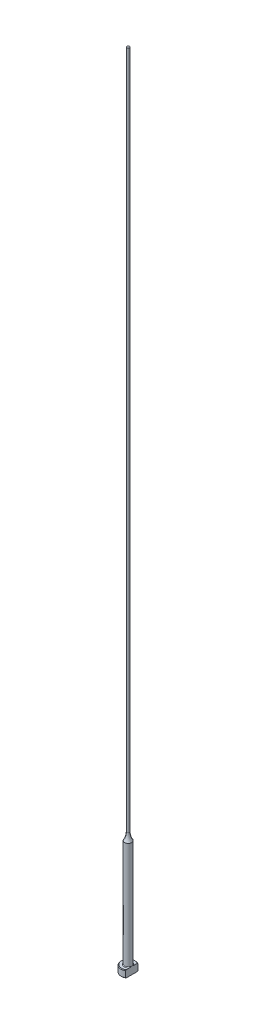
ISO-10303-21;
HEADER;
FILE_DESCRIPTION(('STEP AP214'),'2;1');
FILE_NAME('part.step','',(''),(''),'','','');
FILE_SCHEMA(('AUTOMOTIVE_DESIGN { 1 0 10303 214 1 1 1 1 }'));
ENDSEC;
DATA;
#1=APPLICATION_CONTEXT('core data for automotive mechanical design processes');
#2=APPLICATION_PROTOCOL_DEFINITION('international standard','automotive_design',2000,#1);
#3=PRODUCT_CONTEXT('',#1,'mechanical');
#4=PRODUCT('Part','Part','',(#3));
#5=PRODUCT_RELATED_PRODUCT_CATEGORY('part','',(#4));
#6=PRODUCT_DEFINITION_FORMATION('','',#4);
#7=PRODUCT_DEFINITION_CONTEXT('part definition',#1,'design');
#8=PRODUCT_DEFINITION('design','',#6,#7);
#9=PRODUCT_DEFINITION_SHAPE('','',#8);
#10=(LENGTH_UNIT() NAMED_UNIT(*) SI_UNIT(.MILLI.,.METRE.));
#11=(NAMED_UNIT(*) PLANE_ANGLE_UNIT() SI_UNIT($,.RADIAN.));
#12=(NAMED_UNIT(*) SI_UNIT($,.STERADIAN.) SOLID_ANGLE_UNIT());
#13=UNCERTAINTY_MEASURE_WITH_UNIT(LENGTH_MEASURE(1.E-05),#10,'distance_accuracy_value','');
#14=(GEOMETRIC_REPRESENTATION_CONTEXT(3) GLOBAL_UNCERTAINTY_ASSIGNED_CONTEXT((#13)) GLOBAL_UNIT_ASSIGNED_CONTEXT((#10,
#11,#12)) REPRESENTATION_CONTEXT('',''));
#15=CARTESIAN_POINT('',(0.,0.,0.));
#16=DIRECTION('',(0.,0.,1.));
#17=DIRECTION('',(1.,0.,0.));
#18=AXIS2_PLACEMENT_3D('',#15,#16,#17);
#19=CARTESIAN_POINT('',(-3.17499999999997,3.175,0.));
#20=DIRECTION('',(0.,1.,0.));
#21=DIRECTION('',(0.,0.,1.));
#22=AXIS2_PLACEMENT_3D('',#19,#20,#21);
#23=PLANE('',#22);
#24=CARTESIAN_POINT('',(0.,3.175,0.));
#25=DIRECTION('',(0.,1.,0.));
#26=DIRECTION('',(0.,0.,1.));
#27=AXIS2_PLACEMENT_3D('',#24,#25,#26);
#28=CIRCLE('',#27,2.92099999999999);
#29=CARTESIAN_POINT('',(1.58749999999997,3.175,-2.4519552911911));
#30=VERTEX_POINT('',#29);
#31=CARTESIAN_POINT('',(1.58749999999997,3.175,2.4519552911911));
#32=VERTEX_POINT('',#31);
#33=EDGE_CURVE('E105',#30,#32,#28,.T.);
#34=ORIENTED_EDGE('',*,*,#33,.T.);
#35=DIRECTION('',(0.,0.,1.));
#36=VECTOR('',#35,1.);
#37=CARTESIAN_POINT('',(1.58749999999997,3.17499999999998,2.74963065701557));
#38=LINE('',#37,#36);
#39=CARTESIAN_POINT('',(1.58749999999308,3.175,0.933255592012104));
#40=VERTEX_POINT('',#39);
#41=EDGE_CURVE('E126',#40,#32,#38,.T.);
#42=ORIENTED_EDGE('',*,*,#41,.F.);
#43=CARTESIAN_POINT('',(0.,3.175,0.));
#44=DIRECTION('',(0.,1.,0.));
#45=DIRECTION('',(0.,0.,1.));
#46=AXIS2_PLACEMENT_3D('',#43,#44,#45);
#47=CIRCLE('',#46,1.84149999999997);
#48=CARTESIAN_POINT('',(1.58749999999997,3.17500000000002,-0.933255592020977));
#49=VERTEX_POINT('',#48);
#50=EDGE_CURVE('E11',#40,#49,#47,.F.);
#51=ORIENTED_EDGE('',*,*,#50,.T.);
#52=EDGE_CURVE('E52',#30,#49,#38,.T.);
#53=ORIENTED_EDGE('',*,*,#52,.F.);
#54=EDGE_LOOP('',(#34,#42,#51,#53));
#55=FACE_BOUND('',#54,.T.);
#56=ADVANCED_FACE('F32',(#55),#23,.T.);
#57=CARTESIAN_POINT('',(0.,259.958771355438,0.));
#58=DIRECTION('',(0.,1.,0.));
#59=DIRECTION('',(0.,0.,1.));
#60=AXIS2_PLACEMENT_3D('',#57,#58,#59);
#61=CYLINDRICAL_SURFACE('',#60,3.17499999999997);
#62=CARTESIAN_POINT('',(0.,2.92100000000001,0.));
#63=DIRECTION('',(0.,1.,0.));
#64=DIRECTION('',(0.,0.,1.));
#65=AXIS2_PLACEMENT_3D('',#62,#63,#64);
#66=CIRCLE('',#65,3.17499999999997);
#67=CARTESIAN_POINT('',(1.58749999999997,2.92100000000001,2.74963065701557));
#68=VERTEX_POINT('',#67);
#69=CARTESIAN_POINT('',(1.58749999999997,2.92100000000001,-2.74963065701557));
#70=VERTEX_POINT('',#69);
#71=EDGE_CURVE('E98',#68,#70,#66,.F.);
#72=ORIENTED_EDGE('',*,*,#71,.T.);
#73=DIRECTION('',(0.,-1.,0.));
#74=VECTOR('',#73,1.);
#75=CARTESIAN_POINT('',(1.58749999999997,355.601,-2.74963065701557));
#76=LINE('',#75,#74);
#77=CARTESIAN_POINT('',(1.58749999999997,0.253999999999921,-2.74963065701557));
#78=VERTEX_POINT('',#77);
#79=EDGE_CURVE('E141',#70,#78,#76,.T.);
#80=ORIENTED_EDGE('',*,*,#79,.T.);
#81=CARTESIAN_POINT('',(0.,0.253999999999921,0.));
#82=DIRECTION('',(0.,-1.,0.));
#83=DIRECTION('',(0.,0.,-1.));
#84=AXIS2_PLACEMENT_3D('',#81,#82,#83);
#85=CIRCLE('',#84,3.17499999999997);
#86=CARTESIAN_POINT('',(1.58749999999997,0.253999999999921,2.74963065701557));
#87=VERTEX_POINT('',#86);
#88=EDGE_CURVE('E95',#78,#87,#85,.F.);
#89=ORIENTED_EDGE('',*,*,#88,.T.);
#90=DIRECTION('',(0.,-1.,0.));
#91=VECTOR('',#90,1.);
#92=CARTESIAN_POINT('',(1.58749999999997,355.601,2.74963065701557));
#93=LINE('',#92,#91);
#94=EDGE_CURVE('E88',#68,#87,#93,.T.);
#95=ORIENTED_EDGE('',*,*,#94,.F.);
#96=EDGE_LOOP('',(#72,#80,#89,#95));
#97=FACE_BOUND('',#96,.T.);
#98=ADVANCED_FACE('F191',(#97),#61,.T.);
#99=CARTESIAN_POINT('',(0.,0.,0.));
#100=DIRECTION('',(0.,-1.,0.));
#101=DIRECTION('',(0.,0.,-1.));
#102=AXIS2_PLACEMENT_3D('',#99,#100,#101);
#103=PLANE('',#102);
#104=CARTESIAN_POINT('',(0.,0.,0.));
#105=DIRECTION('',(0.,-1.,0.));
#106=DIRECTION('',(0.,0.,-1.));
#107=AXIS2_PLACEMENT_3D('',#104,#105,#106);
#108=CIRCLE('',#107,2.92100000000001);
#109=CARTESIAN_POINT('',(1.58749999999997,0.,2.45195529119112));
#110=VERTEX_POINT('',#109);
#111=CARTESIAN_POINT('',(1.58749999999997,0.,-2.45195529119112));
#112=VERTEX_POINT('',#111);
#113=EDGE_CURVE('E93',#110,#112,#108,.T.);
#114=ORIENTED_EDGE('',*,*,#113,.T.);
#115=DIRECTION('',(0.,0.,1.));
#116=VECTOR('',#115,1.);
#117=CARTESIAN_POINT('',(1.58749999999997,0.,2.74963065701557));
#118=LINE('',#117,#116);
#119=EDGE_CURVE('E78',#112,#110,#118,.T.);
#120=ORIENTED_EDGE('',*,*,#119,.T.);
#121=EDGE_LOOP('',(#114,#120));
#122=FACE_BOUND('',#121,.T.);
#123=ADVANCED_FACE('F97',(#122),#103,.T.);
#124=CARTESIAN_POINT('',(0.,3.17499999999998,0.));
#125=DIRECTION('',(0.,-1.,0.));
#126=DIRECTION('',(0.,0.,-1.));
#127=AXIS2_PLACEMENT_3D('',#124,#125,#126);
#128=CONICAL_SURFACE('',#127,2.92100000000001,0.785398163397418);
#129=ORIENTED_EDGE('',*,*,#71,.F.);
#130=CARTESIAN_POINT('',(1.58749999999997,-0.161620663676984,-6.0529050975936));
#131=CARTESIAN_POINT('',(1.58749999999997,-0.0288893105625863,-5.91567682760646));
#132=CARTESIAN_POINT('',(1.58749999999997,0.103699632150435,-5.77831035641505));
#133=CARTESIAN_POINT('',(1.58749999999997,0.368508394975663,-5.50321874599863));
#134=CARTESIAN_POINT('',(1.58749999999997,0.5007282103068,-5.3654936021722));
#135=CARTESIAN_POINT('',(1.58749999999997,0.764778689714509,-5.08953516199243));
#136=CARTESIAN_POINT('',(1.58749999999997,0.896609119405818,-4.95130164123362));
#137=CARTESIAN_POINT('',(1.58749999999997,1.15968706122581,-4.67428233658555));
#138=CARTESIAN_POINT('',(1.58749999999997,1.29093457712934,-4.5354965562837));
#139=CARTESIAN_POINT('',(1.58749999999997,1.55007705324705,-4.25997724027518));
#140=CARTESIAN_POINT('',(1.58749999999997,1.67798684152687,-4.12325766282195));
#141=CARTESIAN_POINT('',(1.58749999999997,1.9328486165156,-3.84892898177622));
#142=CARTESIAN_POINT('',(1.58749999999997,2.05980060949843,-3.71131988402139));
#143=CARTESIAN_POINT('',(1.58749999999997,2.31237508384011,-3.43493978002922));
#144=CARTESIAN_POINT('',(1.58749999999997,2.43799784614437,-3.29616903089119));
#145=CARTESIAN_POINT('',(1.58749999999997,2.68741369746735,-3.01699558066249));
#146=CARTESIAN_POINT('',(1.58749999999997,2.81120686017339,-2.8765929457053));
#147=CARTESIAN_POINT('',(1.58749999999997,3.00875865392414,-2.64816703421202));
#148=CARTESIAN_POINT('',(1.58749999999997,3.08336151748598,-2.56087478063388));
#149=CARTESIAN_POINT('',(1.58749999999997,3.23123871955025,-2.385154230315));
#150=CARTESIAN_POINT('',(1.58749999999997,3.30451292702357,-2.29672582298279));
#151=CARTESIAN_POINT('',(1.58749999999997,3.45004422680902,-2.11747400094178));
#152=CARTESIAN_POINT('',(1.58749999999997,3.52228237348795,-2.02663514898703));
#153=CARTESIAN_POINT('',(1.58749999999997,3.66423097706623,-1.84302524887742));
#154=CARTESIAN_POINT('',(1.58749999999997,3.73394203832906,-1.75025467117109));
#155=CARTESIAN_POINT('',(1.58749999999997,3.87080633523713,-1.56067475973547));
#156=CARTESIAN_POINT('',(1.58749999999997,3.93790459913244,-1.46382547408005));
#157=CARTESIAN_POINT('',(1.58749999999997,4.06669147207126,-1.26632594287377));
#158=CARTESIAN_POINT('',(1.58749999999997,4.12837264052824,-1.16567073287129));
#159=CARTESIAN_POINT('',(1.58749999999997,4.21402252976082,-1.01165766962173));
#160=CARTESIAN_POINT('',(1.58749999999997,4.2412792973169,-0.960142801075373));
#161=CARTESIAN_POINT('',(1.58749999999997,4.29309798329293,-0.85578092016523));
#162=CARTESIAN_POINT('',(1.58749999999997,4.3176594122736,-0.802933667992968));
#163=CARTESIAN_POINT('',(1.58749999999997,4.38614656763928,-0.642461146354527));
#164=CARTESIAN_POINT('',(1.58749999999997,4.42510149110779,-0.532518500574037));
#165=CARTESIAN_POINT('',(1.58749999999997,4.46726244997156,-0.367680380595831));
#166=CARTESIAN_POINT('',(1.58749999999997,4.47844427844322,-0.314802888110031));
#167=CARTESIAN_POINT('',(1.58749999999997,4.49576654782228,-0.208209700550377));
#168=CARTESIAN_POINT('',(1.58749999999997,4.50190743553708,-0.154494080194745));
#169=CARTESIAN_POINT('',(1.58749999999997,4.50871296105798,-0.0468792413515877));
#170=CARTESIAN_POINT('',(1.58749999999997,4.50939451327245,0.00701889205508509));
#171=CARTESIAN_POINT('',(1.58749999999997,4.5052767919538,0.114606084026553));
#172=CARTESIAN_POINT('',(1.58749999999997,4.5004770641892,0.16829512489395));
#173=CARTESIAN_POINT('',(1.58749999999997,4.48579689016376,0.274485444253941));
#174=CARTESIAN_POINT('',(1.58749999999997,4.47596081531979,0.326992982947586));
#175=CARTESIAN_POINT('',(1.58749999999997,4.4518180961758,0.430974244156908));
#176=CARTESIAN_POINT('',(1.58749999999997,4.43750969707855,0.482447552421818));
#177=CARTESIAN_POINT('',(1.58749999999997,4.40502489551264,0.58446088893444));
#178=CARTESIAN_POINT('',(1.58749999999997,4.38682724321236,0.634994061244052));
#179=CARTESIAN_POINT('',(1.58749999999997,4.34729308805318,0.734789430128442));
#180=CARTESIAN_POINT('',(1.58749999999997,4.32595722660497,0.784051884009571));
#181=CARTESIAN_POINT('',(1.58749999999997,4.25791922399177,0.93054934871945));
#182=CARTESIAN_POINT('',(1.58749999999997,4.20736047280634,1.02598802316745));
#183=CARTESIAN_POINT('',(1.58749999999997,4.09955451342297,1.21304313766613));
#184=CARTESIAN_POINT('',(1.58749999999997,4.04229912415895,1.30465471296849));
#185=CARTESIAN_POINT('',(1.58749999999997,3.92308746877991,1.48526211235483));
#186=CARTESIAN_POINT('',(1.58749999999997,3.86111349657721,1.57424615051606));
#187=CARTESIAN_POINT('',(1.58749999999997,3.73408621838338,1.74990003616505));
#188=CARTESIAN_POINT('',(1.58749999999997,3.66903444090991,1.83657099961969));
#189=CARTESIAN_POINT('',(1.58749999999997,3.53583371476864,2.009317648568));
#190=CARTESIAN_POINT('',(1.58749999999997,3.46765527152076,2.09537048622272));
#191=CARTESIAN_POINT('',(1.58749999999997,3.32960643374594,2.26611736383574));
#192=CARTESIAN_POINT('',(1.58749999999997,3.25973586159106,2.35081125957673));
#193=CARTESIAN_POINT('',(1.58749999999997,3.04858139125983,2.60290121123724));
#194=CARTESIAN_POINT('',(1.58749999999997,2.90542388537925,2.7687253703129));
#195=CARTESIAN_POINT('',(1.58749999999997,2.64069522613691,3.06970913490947));
#196=CARTESIAN_POINT('',(1.58749999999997,2.5195945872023,3.20528660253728));
#197=CARTESIAN_POINT('',(1.58749999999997,2.27590400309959,3.47510321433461));
#198=CARTESIAN_POINT('',(1.58749999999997,2.1533140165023,3.60934232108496));
#199=CARTESIAN_POINT('',(1.58749999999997,1.9069423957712,3.87695374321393));
#200=CARTESIAN_POINT('',(1.58749999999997,1.78315974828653,4.01032512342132));
#201=CARTESIAN_POINT('',(1.58749999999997,1.53478104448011,4.2763088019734));
#202=CARTESIAN_POINT('',(1.58749999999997,1.41018498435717,4.40892109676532));
#203=CARTESIAN_POINT('',(1.58749999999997,1.04574684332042,4.79499418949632));
#204=CARTESIAN_POINT('',(1.58749999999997,0.805076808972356,5.04767313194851));
#205=CARTESIAN_POINT('',(1.58749999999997,0.44312150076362,5.42550911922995));
#206=CARTESIAN_POINT('',(1.58749999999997,0.322378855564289,5.55118772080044));
#207=CARTESIAN_POINT('',(1.58749999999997,0.0805914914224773,5.8022520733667));
#208=CARTESIAN_POINT('',(1.58749999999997,-0.0404532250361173,5.92763782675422));
#209=CARTESIAN_POINT('',(1.58749999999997,-0.161620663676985,6.0529050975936));
#210=B_SPLINE_CURVE_WITH_KNOTS('',3,(#130,#131,#132,#133,#134,#135,#136,#137,#138,#139,#140,
#141,#142,#143,#144,#145,#146,#147,#148,#149,#150,#151,#152,#153,#154,#155,#156,#157,#158,#159,
#160,#161,#162,#163,#164,#165,#166,#167,#168,#169,#170,#171,#172,#173,#174,#175,#176,#177,#178,
#179,#180,#181,#182,#183,#184,#185,#186,#187,#188,#189,#190,#191,#192,#193,#194,#195,#196,#197,
#198,#199,#200,#201,#202,#203,#204,#205,#206,#207,#208,#209),.UNSPECIFIED.,.F.,.F.,(4,2,2,2,2,2,
2,2,2,2,2,2,2,2,2,2,2,2,2,2,2,2,2,2,2,2,2,2,2,2,2,2,2,2,2,2,2,2,2,4),(0.,0.572750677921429,
1.14550874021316,1.71856057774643,2.29160869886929,2.85328006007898,3.41494773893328,
3.97649423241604,4.53801804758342,4.88249307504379,5.2270018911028,5.57515326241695,
5.92322081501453,6.27657800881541,6.63041319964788,6.80518126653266,6.97998101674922,
7.32824262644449,7.49018491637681,7.65211285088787,7.81353889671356,7.97497832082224,
8.13501929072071,8.29512313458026,8.45612518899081,8.61709438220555,8.94062993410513,
9.26456495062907,9.58978187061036,9.91483894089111,10.2441741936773,10.5735441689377,
11.2306812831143,11.7760337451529,12.3214014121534,12.8672825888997,13.4131663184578,
14.4600164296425,14.9828595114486,15.505698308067),.UNSPECIFIED.);
#211=EDGE_CURVE('E118',#32,#68,#210,.T.);
#212=ORIENTED_EDGE('',*,*,#211,.F.);
#213=ORIENTED_EDGE('',*,*,#33,.F.);
#214=EDGE_CURVE('E117',#70,#30,#210,.T.);
#215=ORIENTED_EDGE('',*,*,#214,.F.);
#216=EDGE_LOOP('',(#129,#212,#213,#215));
#217=FACE_BOUND('',#216,.T.);
#218=ADVANCED_FACE('F162',(#217),#128,.T.);
#219=CARTESIAN_POINT('',(0.,0.253999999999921,0.));
#220=DIRECTION('',(0.,1.,0.));
#221=DIRECTION('',(0.,0.,1.));
#222=AXIS2_PLACEMENT_3D('',#219,#220,#221);
#223=CONICAL_SURFACE('',#222,3.17499999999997,0.785398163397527);
#224=ORIENTED_EDGE('',*,*,#88,.F.);
#225=CARTESIAN_POINT('',(1.58749999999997,3.33662066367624,6.0529050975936));
#226=CARTESIAN_POINT('',(1.58749999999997,3.20388931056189,5.91567682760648));
#227=CARTESIAN_POINT('',(1.58749999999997,3.07130036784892,5.7783103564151));
#228=CARTESIAN_POINT('',(1.58749999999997,2.80649160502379,5.50321874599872));
#229=CARTESIAN_POINT('',(1.58749999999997,2.6742717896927,5.36549360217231));
#230=CARTESIAN_POINT('',(1.58749999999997,2.41022131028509,5.08953516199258));
#231=CARTESIAN_POINT('',(1.58749999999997,2.27839088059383,4.95130164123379));
#232=CARTESIAN_POINT('',(1.58749999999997,2.01531293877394,4.67428233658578));
#233=CARTESIAN_POINT('',(1.58749999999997,1.88406542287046,4.53549655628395));
#234=CARTESIAN_POINT('',(1.58749999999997,1.62492294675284,4.25997724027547));
#235=CARTESIAN_POINT('',(1.58749999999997,1.49701315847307,4.12325766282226));
#236=CARTESIAN_POINT('',(1.58749999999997,1.24215138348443,3.84892898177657));
#237=CARTESIAN_POINT('',(1.58749999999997,1.11519939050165,3.71131988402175));
#238=CARTESIAN_POINT('',(1.58749999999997,0.862624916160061,3.43493978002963));
#239=CARTESIAN_POINT('',(1.58749999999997,0.737002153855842,3.29616903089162));
#240=CARTESIAN_POINT('',(1.58749999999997,0.487586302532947,3.01699558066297));
#241=CARTESIAN_POINT('',(1.58749999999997,0.363793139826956,2.8765929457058));
#242=CARTESIAN_POINT('',(1.58749999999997,0.166241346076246,2.64816703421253));
#243=CARTESIAN_POINT('',(1.58749999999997,0.0916384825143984,2.56087478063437));
#244=CARTESIAN_POINT('',(1.58749999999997,-0.0562387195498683,2.38515423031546));
#245=CARTESIAN_POINT('',(1.58749999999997,-0.129512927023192,2.29672582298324));
#246=CARTESIAN_POINT('',(1.58749999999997,-0.275044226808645,2.1174740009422));
#247=CARTESIAN_POINT('',(1.58749999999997,-0.347282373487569,2.02663514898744));
#248=CARTESIAN_POINT('',(1.58749999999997,-0.489230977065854,1.8430252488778));
#249=CARTESIAN_POINT('',(1.58749999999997,-0.558942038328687,1.75025467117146));
#250=CARTESIAN_POINT('',(1.58749999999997,-0.695806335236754,1.5606747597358));
#251=CARTESIAN_POINT('',(1.58749999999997,-0.762904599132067,1.46382547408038));
#252=CARTESIAN_POINT('',(1.58749999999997,-0.89169147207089,1.26632594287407));
#253=CARTESIAN_POINT('',(1.58749999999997,-0.953372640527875,1.16567073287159));
#254=CARTESIAN_POINT('',(1.58749999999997,-1.03902252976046,1.01165766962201));
#255=CARTESIAN_POINT('',(1.58749999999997,-1.06627929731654,0.960142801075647));
#256=CARTESIAN_POINT('',(1.58749999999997,-1.11809798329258,0.855780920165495));
#257=CARTESIAN_POINT('',(1.58749999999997,-1.14265941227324,0.802933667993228));
#258=CARTESIAN_POINT('',(1.58749999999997,-1.21114656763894,0.642461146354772));
#259=CARTESIAN_POINT('',(1.58749999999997,-1.25010149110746,0.532518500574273));
#260=CARTESIAN_POINT('',(1.58749999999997,-1.29226244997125,0.367680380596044));
#261=CARTESIAN_POINT('',(1.58749999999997,-1.30344427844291,0.314802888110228));
#262=CARTESIAN_POINT('',(1.58749999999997,-1.32076654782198,0.208209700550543));
#263=CARTESIAN_POINT('',(1.58749999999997,-1.32690743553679,0.154494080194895));
#264=CARTESIAN_POINT('',(1.58749999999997,-1.3337129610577,0.0468792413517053));
#265=CARTESIAN_POINT('',(1.58749999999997,-1.33439451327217,-0.00701889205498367));
#266=CARTESIAN_POINT('',(1.58749999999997,-1.33027679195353,-0.114606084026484));
#267=CARTESIAN_POINT('',(1.58749999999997,-1.32547706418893,-0.168295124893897));
#268=CARTESIAN_POINT('',(1.58749999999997,-1.31079689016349,-0.274485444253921));
#269=CARTESIAN_POINT('',(1.58749999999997,-1.30096081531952,-0.326992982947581));
#270=CARTESIAN_POINT('',(1.58749999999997,-1.27681809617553,-0.430974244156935));
#271=CARTESIAN_POINT('',(1.58749999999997,-1.26250969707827,-0.48244755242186));
#272=CARTESIAN_POINT('',(1.58749999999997,-1.23002489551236,-0.584460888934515));
#273=CARTESIAN_POINT('',(1.58749999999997,-1.21182724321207,-0.634994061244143));
#274=CARTESIAN_POINT('',(1.58749999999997,-1.17229308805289,-0.734789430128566));
#275=CARTESIAN_POINT('',(1.58749999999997,-1.15095722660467,-0.784051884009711));
#276=CARTESIAN_POINT('',(1.58749999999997,-1.08291922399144,-0.930549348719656));
#277=CARTESIAN_POINT('',(1.58749999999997,-1.03236047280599,-1.0259880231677));
#278=CARTESIAN_POINT('',(1.58749999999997,-0.924554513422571,-1.21304313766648));
#279=CARTESIAN_POINT('',(1.58749999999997,-0.867299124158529,-1.30465471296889));
#280=CARTESIAN_POINT('',(1.58749999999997,-0.748087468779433,-1.48526211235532));
#281=CARTESIAN_POINT('',(1.58749999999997,-0.686113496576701,-1.5742461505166));
#282=CARTESIAN_POINT('',(1.58749999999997,-0.559086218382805,-1.74990003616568));
#283=CARTESIAN_POINT('',(1.58749999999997,-0.494034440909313,-1.83657099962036));
#284=CARTESIAN_POINT('',(1.58749999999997,-0.360833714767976,-2.00931764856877));
#285=CARTESIAN_POINT('',(1.58749999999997,-0.292655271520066,-2.09537048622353));
#286=CARTESIAN_POINT('',(1.58749999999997,-0.154606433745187,-2.26611736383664));
#287=CARTESIAN_POINT('',(1.58749999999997,-0.0847358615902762,-2.35081125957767));
#288=CARTESIAN_POINT('',(1.58749999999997,0.126418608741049,-2.60290121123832));
#289=CARTESIAN_POINT('',(1.58749999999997,0.269576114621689,-2.76872537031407));
#290=CARTESIAN_POINT('',(1.58749999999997,0.534304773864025,-3.06970913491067));
#291=CARTESIAN_POINT('',(1.58749999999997,0.655405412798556,-3.20528660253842));
#292=CARTESIAN_POINT('',(1.58749999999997,0.899095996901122,-3.47510321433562));
#293=CARTESIAN_POINT('',(1.58749999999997,1.02168598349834,-3.60934232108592));
#294=CARTESIAN_POINT('',(1.58749999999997,1.26805760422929,-3.87695374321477));
#295=CARTESIAN_POINT('',(1.58749999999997,1.39184025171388,-4.0103251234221));
#296=CARTESIAN_POINT('',(1.58749999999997,1.64021895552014,-4.27630880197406));
#297=CARTESIAN_POINT('',(1.58749999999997,1.76481501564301,-4.40892109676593));
#298=CARTESIAN_POINT('',(1.58749999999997,2.12925315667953,-4.79499418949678));
#299=CARTESIAN_POINT('',(1.58749999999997,2.36992319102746,-5.04767313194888));
#300=CARTESIAN_POINT('',(1.58749999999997,2.73187849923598,-5.42550911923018));
#301=CARTESIAN_POINT('',(1.58749999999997,2.85262114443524,-5.55118772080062));
#302=CARTESIAN_POINT('',(1.58749999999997,3.09440850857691,-5.80225207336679));
#303=CARTESIAN_POINT('',(1.58749999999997,3.21545322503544,-5.92763782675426));
#304=CARTESIAN_POINT('',(1.58749999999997,3.33662066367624,-6.0529050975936));
#305=B_SPLINE_CURVE_WITH_KNOTS('',3,(#225,#226,#227,#228,#229,#230,#231,#232,#233,#234,#235,
#236,#237,#238,#239,#240,#241,#242,#243,#244,#245,#246,#247,#248,#249,#250,#251,#252,#253,#254,
#255,#256,#257,#258,#259,#260,#261,#262,#263,#264,#265,#266,#267,#268,#269,#270,#271,#272,#273,
#274,#275,#276,#277,#278,#279,#280,#281,#282,#283,#284,#285,#286,#287,#288,#289,#290,#291,#292,
#293,#294,#295,#296,#297,#298,#299,#300,#301,#302,#303,#304),.UNSPECIFIED.,.F.,.F.,(4,2,2,2,2,2,
2,2,2,2,2,2,2,2,2,2,2,2,2,2,2,2,2,2,2,2,2,2,2,2,2,2,2,2,2,2,2,2,2,4),(0.,0.572750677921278,
1.14550874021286,1.71856057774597,2.29160869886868,2.85328006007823,3.4149477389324,
3.97649423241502,4.53801804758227,4.88249307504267,5.22700189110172,5.5751532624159,
5.92322081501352,6.27657800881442,6.63041319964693,6.80518126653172,6.9799810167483,
7.3282426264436,7.49018491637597,7.65211285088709,7.81353889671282,7.97497832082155,
8.13501929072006,8.29512313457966,8.45612518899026,8.61709438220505,8.9406299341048,
9.2645649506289,9.58978187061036,9.91483894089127,10.2441741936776,10.5735441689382,
11.2306812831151,11.7760337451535,12.3214014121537,12.8672825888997,13.4131663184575,
14.4600164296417,14.9828595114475,15.5056983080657),.UNSPECIFIED.);
#306=EDGE_CURVE('E81',#112,#78,#305,.T.);
#307=ORIENTED_EDGE('',*,*,#306,.F.);
#308=ORIENTED_EDGE('',*,*,#113,.F.);
#309=EDGE_CURVE('E84',#87,#110,#305,.T.);
#310=ORIENTED_EDGE('',*,*,#309,.F.);
#311=EDGE_LOOP('',(#224,#307,#308,#310));
#312=FACE_BOUND('',#311,.T.);
#313=ADVANCED_FACE('F92',(#312),#223,.T.);
#314=CARTESIAN_POINT('',(0.,3.42900000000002,0.));
#315=DIRECTION('',(0.,1.,0.));
#316=DIRECTION('',(0.,0.,1.));
#317=AXIS2_PLACEMENT_3D('',#314,#315,#316);
#318=TOROIDAL_SURFACE('',#317,1.84149999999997,0.254);
#319=CARTESIAN_POINT('',(1.58749999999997,3.42900000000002,0.));
#320=CARTESIAN_POINT('',(1.58749999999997,3.42899942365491,-1.9220514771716E-10));
#321=CARTESIAN_POINT('',(1.58749999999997,3.42899884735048,-1.2261161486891E-07));
#322=CARTESIAN_POINT('',(1.58749999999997,3.42899773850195,-5.09676365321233E-07));
#323=CARTESIAN_POINT('',(1.58749999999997,3.42899720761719,-7.78176328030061E-07));
#324=CARTESIAN_POINT('',(1.58749999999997,3.42899614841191,-1.42307272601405E-06));
#325=CARTESIAN_POINT('',(1.58749999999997,3.42899562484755,-1.80713867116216E-06));
#326=CARTESIAN_POINT('',(1.58749999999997,3.42899463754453,-2.63494846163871E-06));
#327=CARTESIAN_POINT('',(1.58749999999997,3.42899417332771,-3.07814756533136E-06));
#328=CARTESIAN_POINT('',(1.58749999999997,3.42899261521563,-4.66897357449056E-06));
#329=CARTESIAN_POINT('',(1.58749999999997,3.42899159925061,-5.89404908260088E-06));
#330=CARTESIAN_POINT('',(1.58749999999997,3.42898979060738,-8.42427511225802E-06));
#331=CARTESIAN_POINT('',(1.58749999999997,3.42898899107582,-9.7248057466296E-06));
#332=CARTESIAN_POINT('',(1.58749999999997,3.42898598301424,-1.48060601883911E-05));
#333=CARTESIAN_POINT('',(1.58749999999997,3.42898393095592,-1.86838281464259E-05));
#334=CARTESIAN_POINT('',(1.58749999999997,3.42898057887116,-2.63261117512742E-05));
#335=CARTESIAN_POINT('',(1.58749999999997,3.42897922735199,-3.00687417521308E-05));
#336=CARTESIAN_POINT('',(1.58749999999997,3.42897347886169,-4.60276298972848E-05));
#337=CARTESIAN_POINT('',(1.58749999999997,3.42896911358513,-5.8247019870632E-05));
#338=CARTESIAN_POINT('',(1.58749999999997,3.42896211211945,-8.11070097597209E-05));
#339=CARTESIAN_POINT('',(1.58749999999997,3.42895931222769,-9.16953114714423E-05));
#340=CARTESIAN_POINT('',(1.58749999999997,3.42893712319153,-0.000168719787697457));
#341=CARTESIAN_POINT('',(1.58749999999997,3.42890881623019,-0.000232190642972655));
#342=CARTESIAN_POINT('',(1.58749999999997,3.42880276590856,-0.000479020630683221));
#343=CARTESIAN_POINT('',(1.58749999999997,3.42873165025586,-0.00066443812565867));
#344=CARTESIAN_POINT('',(1.58749999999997,3.42845137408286,-0.0013844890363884));
#345=CARTESIAN_POINT('',(1.58749999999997,3.42823526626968,-0.00191701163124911));
#346=CARTESIAN_POINT('',(1.58749999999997,3.42735449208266,-0.00409774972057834));
#347=CARTESIAN_POINT('',(1.58749999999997,3.42669768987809,-0.00574830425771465));
#348=CARTESIAN_POINT('',(1.58749999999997,3.4174405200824,-0.0289985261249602));
#349=CARTESIAN_POINT('',(1.58749999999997,3.40878325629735,-0.0505816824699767));
#350=CARTESIAN_POINT('',(1.58749999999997,3.39189297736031,-0.0929947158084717));
#351=CARTESIAN_POINT('',(1.58749999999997,3.38365605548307,-0.11382315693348));
#352=CARTESIAN_POINT('',(1.58749999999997,3.36635393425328,-0.157956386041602));
#353=CARTESIAN_POINT('',(1.58749999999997,3.35730391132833,-0.181267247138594));
#354=CARTESIAN_POINT('',(1.58749999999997,3.33936775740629,-0.228222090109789));
#355=CARTESIAN_POINT('',(1.58749999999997,3.33048420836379,-0.25186705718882));
#356=CARTESIAN_POINT('',(1.58749999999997,3.30894496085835,-0.310512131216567));
#357=CARTESIAN_POINT('',(1.58749999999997,3.29649449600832,-0.345588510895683));
#358=CARTESIAN_POINT('',(1.58749999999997,3.27296975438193,-0.415278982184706));
#359=CARTESIAN_POINT('',(1.58749999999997,3.26186987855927,-0.449884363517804));
#360=CARTESIAN_POINT('',(1.58749999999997,3.2395832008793,-0.524471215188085));
#361=CARTESIAN_POINT('',(1.58749999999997,3.22860862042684,-0.564517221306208));
#362=CARTESIAN_POINT('',(1.58749999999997,3.20902534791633,-0.645529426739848));
#363=CARTESIAN_POINT('',(1.58749999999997,3.20043582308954,-0.686500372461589));
#364=CARTESIAN_POINT('',(1.58749999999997,3.18611712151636,-0.771546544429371));
#365=CARTESIAN_POINT('',(1.58749999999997,3.18059550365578,-0.815658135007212));
#366=CARTESIAN_POINT('',(1.58749999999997,3.17455396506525,-0.904117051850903));
#367=CARTESIAN_POINT('',(1.58749999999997,3.17401361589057,-0.948462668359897));
#368=CARTESIAN_POINT('',(1.58749999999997,3.17898948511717,-1.02531896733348));
#369=CARTESIAN_POINT('',(1.58749999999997,3.1829739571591,-1.05792141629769));
#370=CARTESIAN_POINT('',(1.58749999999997,3.19569167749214,-1.12184393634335));
#371=CARTESIAN_POINT('',(1.58749999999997,3.20436049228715,-1.1531753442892));
#372=CARTESIAN_POINT('',(1.58749999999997,3.22236152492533,-1.19946468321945));
#373=CARTESIAN_POINT('',(1.58749999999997,3.2295150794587,-1.21526783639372));
#374=CARTESIAN_POINT('',(1.58749999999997,3.24587062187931,-1.24583726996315));
#375=CARTESIAN_POINT('',(1.58749999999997,3.25507530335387,-1.26060215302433));
#376=CARTESIAN_POINT('',(1.58749999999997,3.27378481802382,-1.28575815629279));
#377=CARTESIAN_POINT('',(1.58749999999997,3.28289001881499,-1.29644383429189));
#378=CARTESIAN_POINT('',(1.58749999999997,3.30268460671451,-1.31623154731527));
#379=CARTESIAN_POINT('',(1.58749999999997,3.31337067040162,-1.32533681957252));
#380=CARTESIAN_POINT('',(1.58749999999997,3.33349977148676,-1.33941140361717));
#381=CARTESIAN_POINT('',(1.58749999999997,3.34261446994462,-1.34484814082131));
#382=CARTESIAN_POINT('',(1.58749999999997,3.36161455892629,-1.35416329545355));
#383=CARTESIAN_POINT('',(1.58749999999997,3.37149946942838,-1.35804267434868));
#384=CARTESIAN_POINT('',(1.58749999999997,3.39188678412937,-1.36398436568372));
#385=CARTESIAN_POINT('',(1.58749999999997,3.40239309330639,-1.36603350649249));
#386=CARTESIAN_POINT('',(1.58749999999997,3.42360372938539,-1.3680840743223));
#387=CARTESIAN_POINT('',(1.58749999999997,3.43430795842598,-1.36808648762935));
#388=CARTESIAN_POINT('',(1.58749999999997,3.45433283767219,-1.36616208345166));
#389=CARTESIAN_POINT('',(1.58749999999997,3.46367506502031,-1.36444960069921));
#390=CARTESIAN_POINT('',(1.58749999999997,3.48195519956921,-1.35953338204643));
#391=CARTESIAN_POINT('',(1.58749999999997,3.49089304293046,-1.3563294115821));
#392=CARTESIAN_POINT('',(1.58749999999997,3.50850302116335,-1.34848006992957));
#393=CARTESIAN_POINT('',(1.58749999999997,3.5171531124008,-1.34378578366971));
#394=CARTESIAN_POINT('',(1.58749999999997,3.53371257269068,-1.33324445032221));
#395=CARTESIAN_POINT('',(1.58749999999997,3.54162163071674,-1.32739692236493));
#396=CARTESIAN_POINT('',(1.58749999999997,3.56107121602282,-1.31107304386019));
#397=CARTESIAN_POINT('',(1.58749999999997,3.57202221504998,-1.29989286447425));
#398=CARTESIAN_POINT('',(1.58749999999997,3.59202509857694,-1.27593566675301));
#399=CARTESIAN_POINT('',(1.58749999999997,3.60107086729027,-1.26315370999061));
#400=CARTESIAN_POINT('',(1.58749999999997,3.62186023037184,-1.22930733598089));
#401=CARTESIAN_POINT('',(1.58749999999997,3.63240584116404,-1.20751096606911));
#402=CARTESIAN_POINT('',(1.58749999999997,3.65004643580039,-1.16266144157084));
#403=CARTESIAN_POINT('',(1.58749999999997,3.65714435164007,-1.13960937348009));
#404=CARTESIAN_POINT('',(1.58749999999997,3.67265428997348,-1.07603916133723));
#405=CARTESIAN_POINT('',(1.58749999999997,3.67834921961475,-1.03486686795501));
#406=CARTESIAN_POINT('',(1.58749999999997,3.68382880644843,-0.951558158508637));
#407=CARTESIAN_POINT('',(1.58749999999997,3.68350976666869,-0.909417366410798));
#408=CARTESIAN_POINT('',(1.58749999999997,3.67745397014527,-0.811383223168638));
#409=CARTESIAN_POINT('',(1.58749999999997,3.66993873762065,-0.755610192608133));
#410=CARTESIAN_POINT('',(1.58749999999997,3.64933373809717,-0.644937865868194));
#411=CARTESIAN_POINT('',(1.58749999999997,3.63621897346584,-0.59004364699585));
#412=CARTESIAN_POINT('',(1.58749999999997,3.60740922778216,-0.485757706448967));
#413=CARTESIAN_POINT('',(1.58749999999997,3.59201096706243,-0.436281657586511));
#414=CARTESIAN_POINT('',(1.58749999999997,3.55922497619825,-0.338551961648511));
#415=CARTESIAN_POINT('',(1.58749999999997,3.5418584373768,-0.290291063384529));
#416=CARTESIAN_POINT('',(1.58749999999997,3.51760237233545,-0.225557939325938));
#417=CARTESIAN_POINT('',(1.58749999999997,3.51126413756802,-0.208874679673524));
#418=CARTESIAN_POINT('',(1.58749999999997,3.49830042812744,-0.17512392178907));
#419=CARTESIAN_POINT('',(1.58749999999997,3.49167176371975,-0.158057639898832));
#420=CARTESIAN_POINT('',(1.58749999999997,3.47585523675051,-0.117638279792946));
#421=CARTESIAN_POINT('',(1.58749999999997,3.46662970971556,-0.0943002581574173));
#422=CARTESIAN_POINT('',(1.58749999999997,3.44889695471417,-0.0497824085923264));
#423=CARTESIAN_POINT('',(1.58749999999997,3.44040039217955,-0.028598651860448));
#424=CARTESIAN_POINT('',(1.58749999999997,3.43130364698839,-0.00575168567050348));
#425=CARTESIAN_POINT('',(1.58749999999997,3.43064818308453,-0.00410451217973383));
#426=CARTESIAN_POINT('',(1.58749999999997,3.42976776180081,-0.00192459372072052));
#427=CARTESIAN_POINT('',(1.58749999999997,3.42955062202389,-0.00138952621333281));
#428=CARTESIAN_POINT('',(1.58749999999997,3.42926908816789,-0.000666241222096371));
#429=CARTESIAN_POINT('',(1.58749999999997,3.42919771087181,-0.000480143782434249));
#430=CARTESIAN_POINT('',(1.58749999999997,3.42909131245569,-0.000232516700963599));
#431=CARTESIAN_POINT('',(1.58749999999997,3.42906294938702,-0.000168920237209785));
#432=CARTESIAN_POINT('',(1.58749999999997,3.42904072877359,-9.17527162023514E-05));
#433=CARTESIAN_POINT('',(1.58749999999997,3.42903792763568,-8.11550293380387E-05));
#434=CARTESIAN_POINT('',(1.58749999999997,3.42903091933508,-5.82743948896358E-05));
#435=CARTESIAN_POINT('',(1.58749999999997,3.42902654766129,-4.60440001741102E-05));
#436=CARTESIAN_POINT('',(1.58749999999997,3.42902079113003,-3.00727682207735E-05));
#437=CARTESIAN_POINT('',(1.58749999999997,3.42901943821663,-2.63286807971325E-05));
#438=CARTESIAN_POINT('',(1.58749999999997,3.42901608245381,-1.86836529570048E-05));
#439=CARTESIAN_POINT('',(1.58749999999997,3.4290140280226,-1.48046517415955E-05));
#440=CARTESIAN_POINT('',(1.58749999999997,3.42901101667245,-9.72223943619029E-06));
#441=CARTESIAN_POINT('',(1.58749999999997,3.42901021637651,-8.42159649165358E-06));
#442=CARTESIAN_POINT('',(1.58749999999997,3.42900840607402,-5.89129729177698E-06));
#443=CARTESIAN_POINT('',(1.58749999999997,3.42900738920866,-4.66626867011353E-06));
#444=CARTESIAN_POINT('',(1.58749999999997,3.42900582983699,-3.07568803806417E-06));
#445=CARTESIAN_POINT('',(1.58749999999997,3.42900536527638,-2.63259565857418E-06));
#446=CARTESIAN_POINT('',(1.58749999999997,3.4290043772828,-1.80506085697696E-06));
#447=CARTESIAN_POINT('',(1.58749999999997,3.42900385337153,-1.42116387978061E-06));
#448=CARTESIAN_POINT('',(1.58749999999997,3.42900279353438,-7.76675643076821E-07));
#449=CARTESIAN_POINT('',(1.58749999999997,3.42900226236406,-5.08406487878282E-07));
#450=CARTESIAN_POINT('',(1.58749999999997,3.42900115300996,-1.21901887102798E-07));
#451=CARTESIAN_POINT('',(1.58749999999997,3.42900057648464,1.92251677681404E-10));
#452=CARTESIAN_POINT('',(1.58749999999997,3.42900000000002,0.));
#453=B_SPLINE_CURVE_WITH_KNOTS('',3,(#319,#320,#321,#322,#323,#324,#325,#326,#327,#328,#329,
#330,#331,#332,#333,#334,#335,#336,#337,#338,#339,#340,#341,#342,#343,#344,#345,#346,#347,#348,
#349,#350,#351,#352,#353,#354,#355,#356,#357,#358,#359,#360,#361,#362,#363,#364,#365,#366,#367,
#368,#369,#370,#371,#372,#373,#374,#375,#376,#377,#378,#379,#380,#381,#382,#383,#384,#385,#386,
#387,#388,#389,#390,#391,#392,#393,#394,#395,#396,#397,#398,#399,#400,#401,#402,#403,#404,#405,
#406,#407,#408,#409,#410,#411,#412,#413,#414,#415,#416,#417,#418,#419,#420,#421,#422,#423,#424,
#425,#426,#427,#428,#429,#430,#431,#432,#433,#434,#435,#436,#437,#438,#439,#440,#441,#442,#443,
#444,#445,#446,#447,#448,#449,#450,#451,#452),.UNSPECIFIED.,.T.,.F.,(4,2,2,2,2,2,2,2,2,2,2,2,2,
2,2,2,2,2,2,2,2,2,2,2,2,2,2,2,2,2,2,2,2,2,2,2,2,2,2,2,2,2,2,2,2,2,2,2,2,2,2,2,2,2,2,2,2,2,2,2,2,
2,2,2,2,2,4),(0.,1.72815458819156E-06,3.50429255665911E-06,5.44431004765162E-06,
7.3675525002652E-06,1.2119089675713E-05,1.66953775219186E-05,2.98160400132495E-05,
4.17409564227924E-05,8.0660475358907E-05,0.000113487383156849,0.000321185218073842,
0.000917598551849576,0.00264089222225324,0.00797105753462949,0.0777276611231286,
0.144923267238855,0.219939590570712,0.295714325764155,0.407362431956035,0.516367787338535,
0.640878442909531,0.766362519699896,0.899536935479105,1.03216495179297,1.13045740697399,
1.22743103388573,1.27935899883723,1.33135556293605,1.37333248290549,1.41522237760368,
1.44693946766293,1.47863694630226,1.51056074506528,1.54246916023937,1.57083210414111,
1.59919951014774,1.62861579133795,1.65804436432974,1.70472658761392,1.75155645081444,
1.82378709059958,1.89595619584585,2.01995471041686,2.1460932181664,2.31447224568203,
2.48361094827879,2.6389891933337,2.79283011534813,2.84637031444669,2.9012946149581,
2.97658236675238,3.04504771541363,3.05036697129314,3.05209849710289,3.05269709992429,
3.05290520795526,3.05293806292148,3.05297701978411,3.05298895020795,3.05300207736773,
3.05300665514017,3.0530114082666,3.05301333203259,3.05301527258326,3.05301704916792,
3.05301877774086),.UNSPECIFIED.);
#454=CARTESIAN_POINT('',(1.58749999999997,3.42900000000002,0.));
#455=VERTEX_POINT('',#454);
#456=EDGE_CURVE('E47',#455,#49,#453,.T.);
#457=ORIENTED_EDGE('',*,*,#456,.T.);
#458=ORIENTED_EDGE('',*,*,#50,.F.);
#459=CARTESIAN_POINT('',(1.58749999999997,3.42900000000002,0.));
#460=CARTESIAN_POINT('',(1.58749999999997,3.42900057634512,1.9220512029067E-10));
#461=CARTESIAN_POINT('',(1.58749999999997,3.42900115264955,1.22611614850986E-07));
#462=CARTESIAN_POINT('',(1.58749999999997,3.42900226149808,5.09676365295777E-07));
#463=CARTESIAN_POINT('',(1.58749999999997,3.42900279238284,7.78176328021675E-07));
#464=CARTESIAN_POINT('',(1.58749999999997,3.42900385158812,1.42307272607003E-06));
#465=CARTESIAN_POINT('',(1.58749999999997,3.42900437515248,1.80713867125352E-06));
#466=CARTESIAN_POINT('',(1.58749999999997,3.4290053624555,2.63494846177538E-06));
#467=CARTESIAN_POINT('',(1.58749999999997,3.42900582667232,3.0781475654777E-06));
#468=CARTESIAN_POINT('',(1.58749999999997,3.4290073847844,4.66897357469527E-06));
#469=CARTESIAN_POINT('',(1.58749999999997,3.42900840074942,5.89404908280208E-06));
#470=CARTESIAN_POINT('',(1.58749999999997,3.42901020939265,8.42427511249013E-06));
#471=CARTESIAN_POINT('',(1.58749999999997,3.42901100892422,9.72480574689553E-06));
#472=CARTESIAN_POINT('',(1.58749999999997,3.42901401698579,1.48060601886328E-05));
#473=CARTESIAN_POINT('',(1.58749999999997,3.42901606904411,1.86838281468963E-05));
#474=CARTESIAN_POINT('',(1.58749999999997,3.42901942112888,2.63261117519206E-05));
#475=CARTESIAN_POINT('',(1.58749999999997,3.42902077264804,3.00687417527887E-05));
#476=CARTESIAN_POINT('',(1.58749999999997,3.42902652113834,4.60276298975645E-05));
#477=CARTESIAN_POINT('',(1.58749999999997,3.4290308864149,5.82470198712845E-05));
#478=CARTESIAN_POINT('',(1.58749999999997,3.42903788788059,8.11070097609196E-05));
#479=CARTESIAN_POINT('',(1.58749999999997,3.42904068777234,9.16953114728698E-05));
#480=CARTESIAN_POINT('',(1.58749999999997,3.4290628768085,0.000168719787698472));
#481=CARTESIAN_POINT('',(1.58749999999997,3.42909118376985,0.000232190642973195));
#482=CARTESIAN_POINT('',(1.58749999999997,3.42919723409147,0.000479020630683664));
#483=CARTESIAN_POINT('',(1.58749999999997,3.42926834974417,0.000664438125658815));
#484=CARTESIAN_POINT('',(1.58749999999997,3.42954862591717,0.00138448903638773));
#485=CARTESIAN_POINT('',(1.58749999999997,3.42976473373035,0.00191701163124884));
#486=CARTESIAN_POINT('',(1.58749999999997,3.43064550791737,0.00409774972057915));
#487=CARTESIAN_POINT('',(1.58749999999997,3.43130231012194,0.00574830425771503));
#488=CARTESIAN_POINT('',(1.58749999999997,3.44055947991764,0.0289985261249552));
#489=CARTESIAN_POINT('',(1.58749999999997,3.44921674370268,0.0505816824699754));
#490=CARTESIAN_POINT('',(1.58749999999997,3.46610702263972,0.0929947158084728));
#491=CARTESIAN_POINT('',(1.58749999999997,3.47434394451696,0.11382315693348));
#492=CARTESIAN_POINT('',(1.58749999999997,3.49164606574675,0.157956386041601));
#493=CARTESIAN_POINT('',(1.58749999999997,3.5006960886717,0.181267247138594));
#494=CARTESIAN_POINT('',(1.58749999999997,3.51863224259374,0.228222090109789));
#495=CARTESIAN_POINT('',(1.58749999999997,3.52751579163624,0.25186705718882));
#496=CARTESIAN_POINT('',(1.58749999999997,3.54905503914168,0.310512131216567));
#497=CARTESIAN_POINT('',(1.58749999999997,3.56150550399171,0.345588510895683));
#498=CARTESIAN_POINT('',(1.58749999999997,3.5850302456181,0.415278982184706));
#499=CARTESIAN_POINT('',(1.58749999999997,3.59613012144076,0.449884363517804));
#500=CARTESIAN_POINT('',(1.58749999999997,3.61841679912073,0.524471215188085));
#501=CARTESIAN_POINT('',(1.58749999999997,3.62939137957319,0.564517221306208));
#502=CARTESIAN_POINT('',(1.58749999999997,3.6489746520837,0.645529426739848));
#503=CARTESIAN_POINT('',(1.58749999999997,3.65756417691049,0.686500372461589));
#504=CARTESIAN_POINT('',(1.58749999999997,3.67188287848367,0.771546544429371));
#505=CARTESIAN_POINT('',(1.58749999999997,3.67740449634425,0.815658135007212));
#506=CARTESIAN_POINT('',(1.58749999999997,3.68344603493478,0.904117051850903));
#507=CARTESIAN_POINT('',(1.58749999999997,3.68398638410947,0.948462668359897));
#508=CARTESIAN_POINT('',(1.58749999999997,3.67901051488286,1.02531896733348));
#509=CARTESIAN_POINT('',(1.58749999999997,3.67502604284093,1.05792141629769));
#510=CARTESIAN_POINT('',(1.58749999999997,3.66230832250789,1.12184393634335));
#511=CARTESIAN_POINT('',(1.58749999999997,3.65363950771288,1.1531753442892));
#512=CARTESIAN_POINT('',(1.58749999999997,3.6356384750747,1.19946468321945));
#513=CARTESIAN_POINT('',(1.58749999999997,3.62848492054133,1.21526783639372));
#514=CARTESIAN_POINT('',(1.58749999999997,3.61212937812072,1.24583726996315));
#515=CARTESIAN_POINT('',(1.58749999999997,3.60292469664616,1.26060215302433));
#516=CARTESIAN_POINT('',(1.58749999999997,3.58421518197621,1.28575815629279));
#517=CARTESIAN_POINT('',(1.58749999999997,3.57510998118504,1.29644383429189));
#518=CARTESIAN_POINT('',(1.58749999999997,3.55531539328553,1.31623154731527));
#519=CARTESIAN_POINT('',(1.58749999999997,3.54462932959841,1.32533681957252));
#520=CARTESIAN_POINT('',(1.58749999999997,3.52450022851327,1.33941140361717));
#521=CARTESIAN_POINT('',(1.58749999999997,3.51538553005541,1.34484814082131));
#522=CARTESIAN_POINT('',(1.58749999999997,3.49638544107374,1.35416329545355));
#523=CARTESIAN_POINT('',(1.58749999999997,3.48650053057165,1.35804267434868));
#524=CARTESIAN_POINT('',(1.58749999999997,3.46611321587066,1.36398436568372));
#525=CARTESIAN_POINT('',(1.58749999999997,3.45560690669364,1.36603350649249));
#526=CARTESIAN_POINT('',(1.58749999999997,3.43439627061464,1.3680840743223));
#527=CARTESIAN_POINT('',(1.58749999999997,3.42369204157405,1.36808648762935));
#528=CARTESIAN_POINT('',(1.58749999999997,3.40366716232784,1.36616208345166));
#529=CARTESIAN_POINT('',(1.58749999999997,3.39432493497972,1.36444960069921));
#530=CARTESIAN_POINT('',(1.58749999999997,3.37604480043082,1.35953338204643));
#531=CARTESIAN_POINT('',(1.58749999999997,3.36710695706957,1.3563294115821));
#532=CARTESIAN_POINT('',(1.58749999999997,3.34949697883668,1.34848006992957));
#533=CARTESIAN_POINT('',(1.58749999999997,3.34084688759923,1.34378578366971));
#534=CARTESIAN_POINT('',(1.58749999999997,3.32428742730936,1.33324445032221));
#535=CARTESIAN_POINT('',(1.58749999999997,3.31637836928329,1.32739692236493));
#536=CARTESIAN_POINT('',(1.58749999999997,3.29692878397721,1.31107304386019));
#537=CARTESIAN_POINT('',(1.58749999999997,3.28597778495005,1.29989286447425));
#538=CARTESIAN_POINT('',(1.58749999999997,3.26597490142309,1.27593566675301));
#539=CARTESIAN_POINT('',(1.58749999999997,3.25692913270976,1.26315370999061));
#540=CARTESIAN_POINT('',(1.58749999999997,3.23613976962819,1.22930733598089));
#541=CARTESIAN_POINT('',(1.58749999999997,3.22559415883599,1.20751096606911));
#542=CARTESIAN_POINT('',(1.58749999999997,3.20795356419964,1.16266144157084));
#543=CARTESIAN_POINT('',(1.58749999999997,3.20085564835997,1.13960937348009));
#544=CARTESIAN_POINT('',(1.58749999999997,3.18534571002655,1.07603916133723));
#545=CARTESIAN_POINT('',(1.58749999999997,3.17965078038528,1.03486686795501));
#546=CARTESIAN_POINT('',(1.58749999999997,3.1741711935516,0.951558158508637));
#547=CARTESIAN_POINT('',(1.58749999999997,3.17449023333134,0.909417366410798));
#548=CARTESIAN_POINT('',(1.58749999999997,3.18054602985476,0.811383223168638));
#549=CARTESIAN_POINT('',(1.58749999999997,3.18806126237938,0.755610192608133));
#550=CARTESIAN_POINT('',(1.58749999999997,3.20866626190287,0.644937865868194));
#551=CARTESIAN_POINT('',(1.58749999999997,3.2217810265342,0.59004364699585));
#552=CARTESIAN_POINT('',(1.58749999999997,3.25059077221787,0.485757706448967));
#553=CARTESIAN_POINT('',(1.58749999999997,3.2659890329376,0.43628165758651));
#554=CARTESIAN_POINT('',(1.58749999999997,3.29877502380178,0.338551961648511));
#555=CARTESIAN_POINT('',(1.58749999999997,3.31614156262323,0.290291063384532));
#556=CARTESIAN_POINT('',(1.58749999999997,3.34039762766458,0.225557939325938));
#557=CARTESIAN_POINT('',(1.58749999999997,3.346735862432,0.208874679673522));
#558=CARTESIAN_POINT('',(1.58749999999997,3.35969957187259,0.175123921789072));
#559=CARTESIAN_POINT('',(1.58749999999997,3.3663282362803,0.15805763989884));
#560=CARTESIAN_POINT('',(1.58749999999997,3.3821447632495,0.117638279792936));
#561=CARTESIAN_POINT('',(1.58749999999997,3.39137029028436,0.0943002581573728));
#562=CARTESIAN_POINT('',(1.58749999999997,3.40910304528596,0.0497824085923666));
#563=CARTESIAN_POINT('',(1.58749999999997,3.41759960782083,0.0285986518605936));
#564=CARTESIAN_POINT('',(1.58749999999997,3.42669635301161,0.00575168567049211));
#565=CARTESIAN_POINT('',(1.58749999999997,3.42735181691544,0.00410451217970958));
#566=CARTESIAN_POINT('',(1.58749999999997,3.42823223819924,0.00192459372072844));
#567=CARTESIAN_POINT('',(1.58749999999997,3.42844937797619,0.00138952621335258));
#568=CARTESIAN_POINT('',(1.58749999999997,3.42873091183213,0.000666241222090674));
#569=CARTESIAN_POINT('',(1.58749999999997,3.42880228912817,0.000480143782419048));
#570=CARTESIAN_POINT('',(1.58749999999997,3.42890868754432,0.000232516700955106));
#571=CARTESIAN_POINT('',(1.58749999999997,3.42893705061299,0.000168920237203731));
#572=CARTESIAN_POINT('',(1.58749999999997,3.42895927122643,9.17527161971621E-05));
#573=CARTESIAN_POINT('',(1.58749999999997,3.42896207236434,8.1155029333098E-05));
#574=CARTESIAN_POINT('',(1.58749999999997,3.42896908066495,5.82743948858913E-05));
#575=CARTESIAN_POINT('',(1.58749999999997,3.42897345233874,4.60440001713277E-05));
#576=CARTESIAN_POINT('',(1.58749999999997,3.42897920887,3.00727682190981E-05));
#577=CARTESIAN_POINT('',(1.58749999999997,3.42898056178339,2.63286807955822E-05));
#578=CARTESIAN_POINT('',(1.58749999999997,3.42898391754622,1.86836529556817E-05));
#579=CARTESIAN_POINT('',(1.58749999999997,3.42898597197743,1.48046517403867E-05));
#580=CARTESIAN_POINT('',(1.58749999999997,3.42898898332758,9.72223943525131E-06));
#581=CARTESIAN_POINT('',(1.58749999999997,3.42898978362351,8.42159649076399E-06));
#582=CARTESIAN_POINT('',(1.58749999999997,3.42899159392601,5.89129729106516E-06));
#583=CARTESIAN_POINT('',(1.58749999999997,3.42899261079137,4.66626866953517E-06));
#584=CARTESIAN_POINT('',(1.58749999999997,3.42899417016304,3.0756880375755E-06));
#585=CARTESIAN_POINT('',(1.58749999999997,3.42899463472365,2.63259565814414E-06));
#586=CARTESIAN_POINT('',(1.58749999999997,3.42899562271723,1.80506085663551E-06));
#587=CARTESIAN_POINT('',(1.58749999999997,3.42899614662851,1.42116387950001E-06));
#588=CARTESIAN_POINT('',(1.58749999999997,3.42899720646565,7.7667564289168E-07));
#589=CARTESIAN_POINT('',(1.58749999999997,3.42899773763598,5.0840648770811E-07));
#590=CARTESIAN_POINT('',(1.58749999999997,3.42899884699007,1.21901887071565E-07));
#591=CARTESIAN_POINT('',(1.58749999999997,3.42899942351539,-1.92251650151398E-10));
#592=CARTESIAN_POINT('',(1.58749999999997,3.42900000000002,0.));
#593=B_SPLINE_CURVE_WITH_KNOTS('',3,(#459,#460,#461,#462,#463,#464,#465,#466,#467,#468,#469,
#470,#471,#472,#473,#474,#475,#476,#477,#478,#479,#480,#481,#482,#483,#484,#485,#486,#487,#488,
#489,#490,#491,#492,#493,#494,#495,#496,#497,#498,#499,#500,#501,#502,#503,#504,#505,#506,#507,
#508,#509,#510,#511,#512,#513,#514,#515,#516,#517,#518,#519,#520,#521,#522,#523,#524,#525,#526,
#527,#528,#529,#530,#531,#532,#533,#534,#535,#536,#537,#538,#539,#540,#541,#542,#543,#544,#545,
#546,#547,#548,#549,#550,#551,#552,#553,#554,#555,#556,#557,#558,#559,#560,#561,#562,#563,#564,
#565,#566,#567,#568,#569,#570,#571,#572,#573,#574,#575,#576,#577,#578,#579,#580,#581,#582,#583,
#584,#585,#586,#587,#588,#589,#590,#591,#592),.UNSPECIFIED.,.T.,.F.,(4,2,2,2,2,2,2,2,2,2,2,2,2,
2,2,2,2,2,2,2,2,2,2,2,2,2,2,2,2,2,2,2,2,2,2,2,2,2,2,2,2,2,2,2,2,2,2,2,2,2,2,2,2,2,2,2,2,2,2,2,2,
2,2,2,2,2,4),(0.,1.72815458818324E-06,3.50429255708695E-06,5.44431004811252E-06,
7.36755250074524E-06,1.21190896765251E-05,1.66953775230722E-05,2.98160400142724E-05,
4.17409564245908E-05,8.06604753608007E-05,0.000113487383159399,0.000321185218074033,
0.000917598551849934,0.00264089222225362,0.00797105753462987,0.077727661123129,
0.144923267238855,0.219939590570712,0.295714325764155,0.407362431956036,0.516367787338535,
0.640878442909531,0.766362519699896,0.899536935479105,1.03216495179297,1.13045740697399,
1.22743103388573,1.27935899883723,1.33135556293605,1.37333248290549,1.41522237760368,
1.44693946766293,1.47863694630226,1.51056074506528,1.54246916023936,1.57083210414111,
1.59919951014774,1.62861579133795,1.65804436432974,1.70472658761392,1.75155645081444,
1.82378709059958,1.89595619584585,2.01995471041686,2.1460932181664,2.31447224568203,
2.48361094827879,2.6389891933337,2.79283011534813,2.84637031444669,2.9012946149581,
2.97658236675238,3.04504771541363,3.05036697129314,3.05209849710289,3.05269709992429,
3.05290520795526,3.05293806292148,3.05297701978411,3.05298895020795,3.05300207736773,
3.05300665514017,3.0530114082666,3.05301333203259,3.05301527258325,3.05301704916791,
3.05301877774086),.UNSPECIFIED.);
#594=EDGE_CURVE('E147',#40,#455,#593,.T.);
#595=ORIENTED_EDGE('',*,*,#594,.T.);
#596=CARTESIAN_POINT('',(0.,3.42900000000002,0.));
#597=DIRECTION('',(0.,1.,0.));
#598=DIRECTION('',(0.,0.,1.));
#599=AXIS2_PLACEMENT_3D('',#596,#597,#598);
#600=CIRCLE('',#599,1.58749999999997);
#601=EDGE_CURVE('E40',#455,#455,#600,.T.);
#602=ORIENTED_EDGE('',*,*,#601,.F.);
#603=EDGE_LOOP('',(#457,#458,#595,#602));
#604=FACE_BOUND('',#603,.T.);
#605=ADVANCED_FACE('F34',(#604),#318,.F.);
#606=CARTESIAN_POINT('',(-0.594359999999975,355.6,0.));
#607=DIRECTION('',(0.,1.,0.));
#608=DIRECTION('',(0.,0.,1.));
#609=AXIS2_PLACEMENT_3D('',#606,#607,#608);
#610=PLANE('',#609);
#611=CARTESIAN_POINT('',(0.,355.6,0.));
#612=DIRECTION('',(0.,1.,0.));
#613=DIRECTION('',(0.,0.,1.));
#614=AXIS2_PLACEMENT_3D('',#611,#612,#613);
#615=CIRCLE('',#614,0.594359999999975);
#616=CARTESIAN_POINT('',(0.,355.6,0.594359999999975));
#617=VERTEX_POINT('',#616);
#618=EDGE_CURVE('E108',#617,#617,#615,.T.);
#619=ORIENTED_EDGE('',*,*,#618,.T.);
#620=EDGE_LOOP('',(#619));
#621=FACE_BOUND('',#620,.T.);
#622=ADVANCED_FACE('F180',(#621),#610,.T.);
#623=CARTESIAN_POINT('',(0.,259.958771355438,0.));
#624=DIRECTION('',(0.,1.,0.));
#625=DIRECTION('',(0.,0.,1.));
#626=AXIS2_PLACEMENT_3D('',#623,#624,#625);
#627=CYLINDRICAL_SURFACE('',#626,0.594359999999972);
#628=CARTESIAN_POINT('',(0.,54.2097728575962,0.));
#629=DIRECTION('',(0.,1.,0.));
#630=DIRECTION('',(0.,0.,1.));
#631=AXIS2_PLACEMENT_3D('',#628,#629,#630);
#632=CIRCLE('',#631,0.59435999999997);
#633=CARTESIAN_POINT('',(0.,54.2097728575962,0.59435999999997));
#634=VERTEX_POINT('',#633);
#635=EDGE_CURVE('E111',#634,#634,#632,.T.);
#636=ORIENTED_EDGE('',*,*,#635,.T.);
#637=EDGE_LOOP('',(#636));
#638=FACE_BOUND('',#637,.T.);
#639=ORIENTED_EDGE('',*,*,#618,.F.);
#640=EDGE_LOOP('',(#639));
#641=FACE_BOUND('',#640,.T.);
#642=ADVANCED_FACE('F174',(#638,#641),#627,.T.);
#643=CARTESIAN_POINT('',(0.,54.2097728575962,0.));
#644=DIRECTION('',(0.,1.,0.));
#645=DIRECTION('',(0.,0.,1.));
#646=AXIS2_PLACEMENT_3D('',#643,#644,#645);
#647=TOROIDAL_SURFACE('',#646,6.94435999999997,6.35);
#648=CARTESIAN_POINT('',(0.,50.8,0.));
#649=DIRECTION('',(0.,1.,0.));
#650=DIRECTION('',(0.,0.,1.));
#651=AXIS2_PLACEMENT_3D('',#648,#649,#650);
#652=CIRCLE('',#651,1.58749999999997);
#653=CARTESIAN_POINT('',(0.,50.8,1.58749999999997));
#654=VERTEX_POINT('',#653);
#655=EDGE_CURVE('E114',#654,#654,#652,.T.);
#656=ORIENTED_EDGE('',*,*,#655,.T.);
#657=EDGE_LOOP('',(#656));
#658=FACE_BOUND('',#657,.T.);
#659=ORIENTED_EDGE('',*,*,#635,.F.);
#660=EDGE_LOOP('',(#659));
#661=FACE_BOUND('',#660,.T.);
#662=ADVANCED_FACE('F168',(#658,#661),#647,.F.);
#663=CARTESIAN_POINT('',(0.,259.958771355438,0.));
#664=DIRECTION('',(0.,1.,0.));
#665=DIRECTION('',(0.,0.,1.));
#666=AXIS2_PLACEMENT_3D('',#663,#664,#665);
#667=CYLINDRICAL_SURFACE('',#666,1.58749999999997);
#668=ORIENTED_EDGE('',*,*,#601,.T.);
#669=EDGE_LOOP('',(#668));
#670=FACE_BOUND('',#669,.T.);
#671=ORIENTED_EDGE('',*,*,#655,.F.);
#672=EDGE_LOOP('',(#671));
#673=FACE_BOUND('',#672,.T.);
#674=ADVANCED_FACE('F165',(#670,#673),#667,.T.);
#675=CARTESIAN_POINT('',(1.58749999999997,355.601,2.74963065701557));
#676=DIRECTION('',(1.,0.,0.));
#677=DIRECTION('',(0.,0.,-1.));
#678=AXIS2_PLACEMENT_3D('',#675,#676,#677);
#679=PLANE('',#678);
#680=ORIENTED_EDGE('',*,*,#309,.T.);
#681=ORIENTED_EDGE('',*,*,#119,.F.);
#682=ORIENTED_EDGE('',*,*,#306,.T.);
#683=ORIENTED_EDGE('',*,*,#79,.F.);
#684=ORIENTED_EDGE('',*,*,#214,.T.);
#685=ORIENTED_EDGE('',*,*,#52,.T.);
#686=ORIENTED_EDGE('',*,*,#456,.F.);
#687=ORIENTED_EDGE('',*,*,#594,.F.);
#688=ORIENTED_EDGE('',*,*,#41,.T.);
#689=ORIENTED_EDGE('',*,*,#211,.T.);
#690=ORIENTED_EDGE('',*,*,#94,.T.);
#691=EDGE_LOOP('',(#680,#681,#682,#683,#684,#685,#686,#687,#688,#689,#690));
#692=FACE_BOUND('',#691,.T.);
#693=ADVANCED_FACE('F80',(#692),#679,.T.);
#694=CLOSED_SHELL('',(#56,#98,#123,#218,#313,#605,#622,#642,#662,#674,#693));
#695=MANIFOLD_SOLID_BREP('B2',#694);
#696=ADVANCED_BREP_SHAPE_REPRESENTATION('',(#18,#695),#14);
#697=SHAPE_DEFINITION_REPRESENTATION(#9,#696);
ENDSEC;
END-ISO-10303-21;
